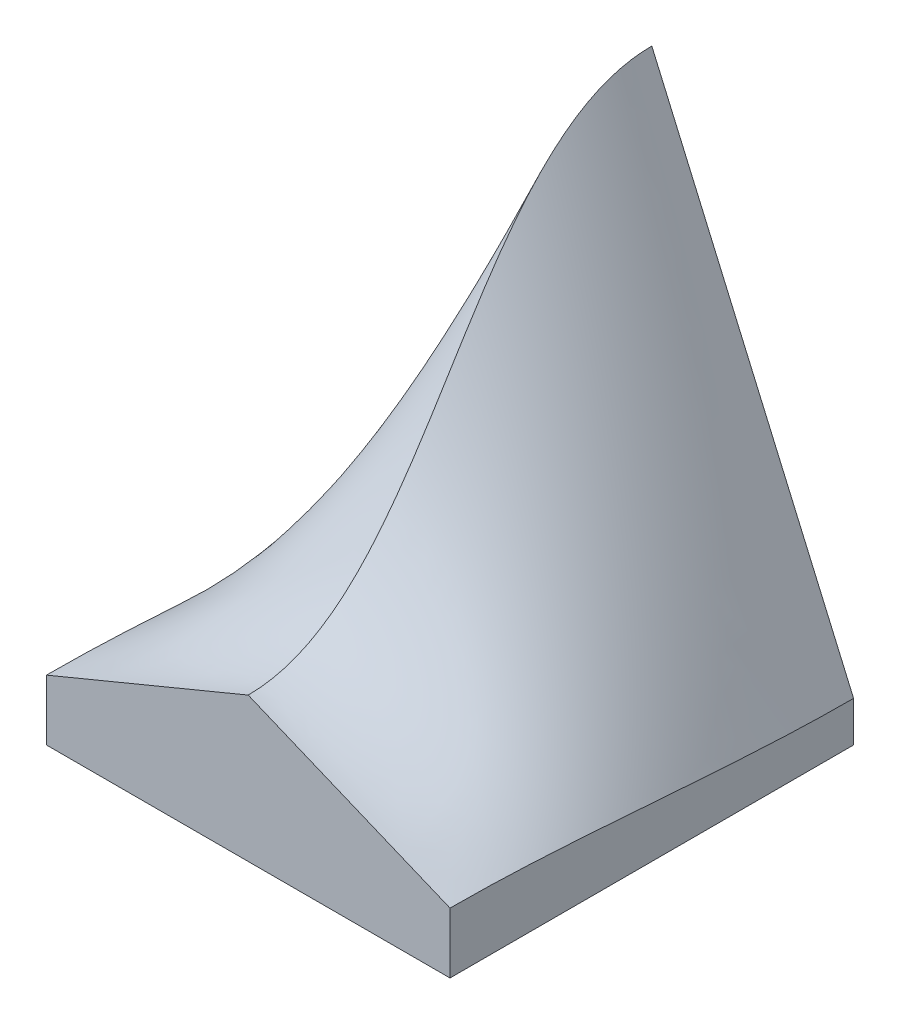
ISO-10303-21;
HEADER;
FILE_DESCRIPTION(('STEP AP214'),'2;1');
FILE_NAME('part.step','',(''),(''),'','','');
FILE_SCHEMA(('AUTOMOTIVE_DESIGN { 1 0 10303 214 1 1 1 1 }'));
ENDSEC;
DATA;
#1=APPLICATION_CONTEXT('core data for automotive mechanical design processes');
#2=APPLICATION_PROTOCOL_DEFINITION('international standard','automotive_design',2000,#1);
#3=PRODUCT_CONTEXT('',#1,'mechanical');
#4=PRODUCT('Part','Part','',(#3));
#5=PRODUCT_RELATED_PRODUCT_CATEGORY('part','',(#4));
#6=PRODUCT_DEFINITION_FORMATION('','',#4);
#7=PRODUCT_DEFINITION_CONTEXT('part definition',#1,'design');
#8=PRODUCT_DEFINITION('design','',#6,#7);
#9=PRODUCT_DEFINITION_SHAPE('','',#8);
#10=(LENGTH_UNIT() NAMED_UNIT(*) SI_UNIT(.MILLI.,.METRE.));
#11=(NAMED_UNIT(*) PLANE_ANGLE_UNIT() SI_UNIT($,.RADIAN.));
#12=(NAMED_UNIT(*) SI_UNIT($,.STERADIAN.) SOLID_ANGLE_UNIT());
#13=UNCERTAINTY_MEASURE_WITH_UNIT(LENGTH_MEASURE(1.E-05),#10,'distance_accuracy_value','');
#14=(GEOMETRIC_REPRESENTATION_CONTEXT(3) GLOBAL_UNCERTAINTY_ASSIGNED_CONTEXT((#13)) GLOBAL_UNIT_ASSIGNED_CONTEXT((#10,
#11,#12)) REPRESENTATION_CONTEXT('',''));
#15=CARTESIAN_POINT('',(0.,0.,0.));
#16=DIRECTION('',(0.,0.,1.));
#17=DIRECTION('',(1.,0.,0.));
#18=AXIS2_PLACEMENT_3D('',#15,#16,#17);
#19=CARTESIAN_POINT('',(0.,0.,-50.0000000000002));
#20=DIRECTION('',(0.,0.,1.));
#21=DIRECTION('',(1.,0.,0.));
#22=AXIS2_PLACEMENT_3D('',#19,#20,#21);
#23=PLANE('',#22);
#24=DIRECTION('',(0.,-1.,0.));
#25=VECTOR('',#24,1.);
#26=CARTESIAN_POINT('',(-25.,5.,-50.0000000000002));
#27=LINE('',#26,#25);
#28=CARTESIAN_POINT('',(-25.,5.,-50.0000000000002));
#29=VERTEX_POINT('',#28);
#30=CARTESIAN_POINT('',(-25.,0.,-50.0000000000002));
#31=VERTEX_POINT('',#30);
#32=EDGE_CURVE('E296',#29,#31,#27,.T.);
#33=ORIENTED_EDGE('',*,*,#32,.F.);
#34=DIRECTION('',(-0.398749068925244,-0.917060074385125,0.));
#35=VECTOR('',#34,1.);
#36=CARTESIAN_POINT('',(-25.,5.,-50.0000000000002));
#37=LINE('',#36,#35);
#38=CARTESIAN_POINT('',(0.,62.4960636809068,-50.0000000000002));
#39=VERTEX_POINT('',#38);
#40=EDGE_CURVE('E12',#39,#29,#37,.T.);
#41=ORIENTED_EDGE('',*,*,#40,.F.);
#42=DIRECTION('',(-0.398749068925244,0.917060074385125,0.));
#43=VECTOR('',#42,1.);
#44=CARTESIAN_POINT('',(0.,62.4960636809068,-50.0000000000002));
#45=LINE('',#44,#43);
#46=CARTESIAN_POINT('',(25.,5.00000000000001,-50.0000000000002));
#47=VERTEX_POINT('',#46);
#48=EDGE_CURVE('E102',#47,#39,#45,.T.);
#49=ORIENTED_EDGE('',*,*,#48,.F.);
#50=DIRECTION('',(0.,1.,0.));
#51=VECTOR('',#50,1.);
#52=CARTESIAN_POINT('',(25.,5.00000000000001,-50.0000000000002));
#53=LINE('',#52,#51);
#54=CARTESIAN_POINT('',(25.,0.,-50.0000000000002));
#55=VERTEX_POINT('',#54);
#56=EDGE_CURVE('E116',#55,#47,#53,.T.);
#57=ORIENTED_EDGE('',*,*,#56,.F.);
#58=DIRECTION('',(1.,0.,0.));
#59=VECTOR('',#58,1.);
#60=CARTESIAN_POINT('',(-25.,0.,-50.0000000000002));
#61=LINE('',#60,#59);
#62=EDGE_CURVE('E110',#31,#55,#61,.T.);
#63=ORIENTED_EDGE('',*,*,#62,.F.);
#64=EDGE_LOOP('',(#33,#41,#49,#57,#63));
#65=FACE_BOUND('',#64,.T.);
#66=ADVANCED_FACE('F92',(#65),#23,.F.);
#67=CARTESIAN_POINT('',(0.,0.,0.));
#68=DIRECTION('',(0.,0.,1.));
#69=DIRECTION('',(1.,0.,0.));
#70=AXIS2_PLACEMENT_3D('',#67,#68,#69);
#71=PLANE('',#70);
#72=DIRECTION('',(0.,1.,0.));
#73=VECTOR('',#72,1.);
#74=CARTESIAN_POINT('',(-25.,7.5,0.));
#75=LINE('',#74,#73);
#76=CARTESIAN_POINT('',(-25.,0.,0.));
#77=VERTEX_POINT('',#76);
#78=CARTESIAN_POINT('',(-25.,7.5,0.));
#79=VERTEX_POINT('',#78);
#80=EDGE_CURVE('E149',#77,#79,#75,.T.);
#81=ORIENTED_EDGE('',*,*,#80,.F.);
#82=DIRECTION('',(-1.,0.,0.));
#83=VECTOR('',#82,1.);
#84=CARTESIAN_POINT('',(-25.,0.,0.));
#85=LINE('',#84,#83);
#86=CARTESIAN_POINT('',(25.,0.,0.));
#87=VERTEX_POINT('',#86);
#88=EDGE_CURVE('E169',#87,#77,#85,.T.);
#89=ORIENTED_EDGE('',*,*,#88,.F.);
#90=DIRECTION('',(0.,-1.,0.));
#91=VECTOR('',#90,1.);
#92=CARTESIAN_POINT('',(25.,7.5,0.));
#93=LINE('',#92,#91);
#94=CARTESIAN_POINT('',(25.,7.5,0.));
#95=VERTEX_POINT('',#94);
#96=EDGE_CURVE('E319',#95,#87,#93,.T.);
#97=ORIENTED_EDGE('',*,*,#96,.F.);
#98=DIRECTION('',(0.923879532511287,-0.382683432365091,0.));
#99=VECTOR('',#98,1.);
#100=CARTESIAN_POINT('',(0.,17.8553390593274,0.));
#101=LINE('',#100,#99);
#102=CARTESIAN_POINT('',(0.,17.8553390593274,0.));
#103=VERTEX_POINT('',#102);
#104=EDGE_CURVE('E152',#103,#95,#101,.T.);
#105=ORIENTED_EDGE('',*,*,#104,.F.);
#106=DIRECTION('',(0.923879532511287,0.382683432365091,0.));
#107=VECTOR('',#106,1.);
#108=CARTESIAN_POINT('',(-25.,7.5,0.));
#109=LINE('',#108,#107);
#110=EDGE_CURVE('E144',#79,#103,#109,.T.);
#111=ORIENTED_EDGE('',*,*,#110,.F.);
#112=EDGE_LOOP('',(#81,#89,#97,#105,#111));
#113=FACE_BOUND('',#112,.T.);
#114=ADVANCED_FACE('F147',(#113),#71,.T.);
#115=CARTESIAN_POINT('',(25.,0.,0.));
#116=DIRECTION('',(0.,-1.,0.));
#117=DIRECTION('',(-1.,0.,0.));
#118=AXIS2_PLACEMENT_3D('',#115,#116,#117);
#119=PLANE('',#118);
#120=ORIENTED_EDGE('',*,*,#88,.T.);
#121=DIRECTION('',(0.,0.,-1.));
#122=VECTOR('',#121,1.);
#123=CARTESIAN_POINT('',(-25.,0.,-25.0000000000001));
#124=LINE('',#123,#122);
#125=EDGE_CURVE('E168',#77,#31,#124,.T.);
#126=ORIENTED_EDGE('',*,*,#125,.T.);
#127=ORIENTED_EDGE('',*,*,#62,.T.);
#128=DIRECTION('',(0.,0.,1.));
#129=VECTOR('',#128,1.);
#130=CARTESIAN_POINT('',(25.,0.,-25.0000000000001));
#131=LINE('',#130,#129);
#132=EDGE_CURVE('E158',#55,#87,#131,.T.);
#133=ORIENTED_EDGE('',*,*,#132,.T.);
#134=EDGE_LOOP('',(#120,#126,#127,#133));
#135=FACE_BOUND('',#134,.T.);
#136=ADVANCED_FACE('F276',(#135),#119,.T.);
#137=CARTESIAN_POINT('',(-25.,0.,0.));
#138=DIRECTION('',(-1.,0.,0.));
#139=DIRECTION('',(0.,1.,0.));
#140=AXIS2_PLACEMENT_3D('',#137,#138,#139);
#141=PLANE('',#140);
#142=ORIENTED_EDGE('',*,*,#80,.T.);
#143=CARTESIAN_POINT('',(-25.,7.5,0.));
#144=CARTESIAN_POINT('',(-25.,7.5,-16.6874869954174));
#145=CARTESIAN_POINT('',(-25.,5.,-33.3125130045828));
#146=CARTESIAN_POINT('',(-25.,5.,-50.0000000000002));
#147=B_SPLINE_CURVE_WITH_KNOTS('',3,(#143,#144,#145,#146),.UNSPECIFIED.,.F.,.F.,(4,4),(0.,1.),.UNSPECIFIED.);
#148=EDGE_CURVE('E166',#79,#29,#147,.T.);
#149=ORIENTED_EDGE('',*,*,#148,.T.);
#150=ORIENTED_EDGE('',*,*,#32,.T.);
#151=ORIENTED_EDGE('',*,*,#125,.F.);
#152=EDGE_LOOP('',(#142,#149,#150,#151));
#153=FACE_BOUND('',#152,.T.);
#154=ADVANCED_FACE('F165',(#153),#141,.T.);
#155=CARTESIAN_POINT('',(25.,7.5,0.));
#156=DIRECTION('',(1.,0.,0.));
#157=DIRECTION('',(0.,-1.,0.));
#158=AXIS2_PLACEMENT_3D('',#155,#156,#157);
#159=PLANE('',#158);
#160=ORIENTED_EDGE('',*,*,#96,.T.);
#161=ORIENTED_EDGE('',*,*,#132,.F.);
#162=ORIENTED_EDGE('',*,*,#56,.T.);
#163=CARTESIAN_POINT('',(25.,7.5,0.));
#164=CARTESIAN_POINT('',(25.,7.5,-16.6874869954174));
#165=CARTESIAN_POINT('',(25.,5.00000000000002,-33.3125130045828));
#166=CARTESIAN_POINT('',(25.,5.00000000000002,-50.0000000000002));
#167=B_SPLINE_CURVE_WITH_KNOTS('',3,(#163,#164,#165,#166),.UNSPECIFIED.,.F.,.F.,(4,4),(0.,1.),.UNSPECIFIED.);
#168=EDGE_CURVE('E177',#95,#47,#167,.T.);
#169=ORIENTED_EDGE('',*,*,#168,.F.);
#170=EDGE_LOOP('',(#160,#161,#162,#169));
#171=FACE_BOUND('',#170,.T.);
#172=ADVANCED_FACE('F246',(#171),#159,.T.);
#173=CARTESIAN_POINT('',(-25.,7.5,0.));
#174=CARTESIAN_POINT('',(-25.,7.5,-16.6874869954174));
#175=CARTESIAN_POINT('',(-25.,5.,-33.3125130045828));
#176=CARTESIAN_POINT('',(-25.,5.,-50.0000000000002));
#177=CARTESIAN_POINT('',(-16.6666666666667,10.9517796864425,0.));
#178=CARTESIAN_POINT('',(-16.6666666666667,10.9517796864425,-18.572581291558));
#179=CARTESIAN_POINT('',(-16.6666666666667,24.1653545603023,-31.4274187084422));
#180=CARTESIAN_POINT('',(-16.6666666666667,24.1653545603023,-50.0000000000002));
#181=CARTESIAN_POINT('',(-8.33333333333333,14.4035593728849,0.));
#182=CARTESIAN_POINT('',(-8.33333333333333,14.4035593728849,-20.4576755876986));
#183=CARTESIAN_POINT('',(-8.33333333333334,43.3307091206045,-29.5423244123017));
#184=CARTESIAN_POINT('',(-8.33333333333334,43.3307091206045,-50.0000000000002));
#185=CARTESIAN_POINT('',(0.,17.8553390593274,0.));
#186=CARTESIAN_POINT('',(0.,17.8553390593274,-22.3427698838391));
#187=CARTESIAN_POINT('',(0.,62.4960636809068,-27.6572301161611));
#188=CARTESIAN_POINT('',(0.,62.4960636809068,-50.0000000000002));
#189=B_SPLINE_SURFACE_WITH_KNOTS('',3,3,((#173,#174,#175,#176),(#177,#178,#179,#180),(#181,#182,
#183,#184),(#185,#186,#187,#188)),.UNSPECIFIED.,.F.,.F.,.F.,(4,4),(4,4),(0.,1.),(0.,1.),.UNSPECIFIED.);
#190=CARTESIAN_POINT('',(0.,17.8553390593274,0.));
#191=CARTESIAN_POINT('',(0.,17.8553390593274,-22.3427698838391));
#192=CARTESIAN_POINT('',(0.,62.4960636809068,-27.6572301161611));
#193=CARTESIAN_POINT('',(0.,62.4960636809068,-50.0000000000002));
#194=B_SPLINE_CURVE_WITH_KNOTS('',3,(#190,#191,#192,#193),.UNSPECIFIED.,.F.,.F.,(4,4),(0.,1.),.UNSPECIFIED.);
#195=EDGE_CURVE('E175',#103,#39,#194,.T.);
#196=ORIENTED_EDGE('',*,*,#110,.T.);
#197=ORIENTED_EDGE('',*,*,#195,.T.);
#198=ORIENTED_EDGE('',*,*,#40,.T.);
#199=ORIENTED_EDGE('',*,*,#148,.F.);
#200=EDGE_LOOP('',(#196,#197,#198,#199));
#201=FACE_BOUND('',#200,.T.);
#202=ADVANCED_FACE('F173',(#201),#189,.T.);
#203=CARTESIAN_POINT('',(0.,17.8553390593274,0.));
#204=CARTESIAN_POINT('',(0.,17.8553390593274,-22.3427698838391));
#205=CARTESIAN_POINT('',(0.,62.4960636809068,-27.6572301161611));
#206=CARTESIAN_POINT('',(0.,62.4960636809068,-50.0000000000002));
#207=CARTESIAN_POINT('',(8.33333333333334,14.4035593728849,0.));
#208=CARTESIAN_POINT('',(8.33333333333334,14.4035593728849,-20.4576755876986));
#209=CARTESIAN_POINT('',(8.33333333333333,43.3307091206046,-29.5423244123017));
#210=CARTESIAN_POINT('',(8.33333333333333,43.3307091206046,-50.0000000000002));
#211=CARTESIAN_POINT('',(16.6666666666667,10.9517796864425,0.));
#212=CARTESIAN_POINT('',(16.6666666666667,10.9517796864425,-18.572581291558));
#213=CARTESIAN_POINT('',(16.6666666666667,24.1653545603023,-31.4274187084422));
#214=CARTESIAN_POINT('',(16.6666666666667,24.1653545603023,-50.0000000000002));
#215=CARTESIAN_POINT('',(25.,7.5,0.));
#216=CARTESIAN_POINT('',(25.,7.5,-16.6874869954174));
#217=CARTESIAN_POINT('',(25.,5.00000000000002,-33.3125130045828));
#218=CARTESIAN_POINT('',(25.,5.00000000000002,-50.0000000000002));
#219=B_SPLINE_SURFACE_WITH_KNOTS('',3,3,((#203,#204,#205,#206),(#207,#208,#209,#210),(#211,#212,
#213,#214),(#215,#216,#217,#218)),.UNSPECIFIED.,.F.,.F.,.F.,(4,4),(4,4),(0.,1.),(0.,1.),.UNSPECIFIED.);
#220=ORIENTED_EDGE('',*,*,#104,.T.);
#221=ORIENTED_EDGE('',*,*,#168,.T.);
#222=ORIENTED_EDGE('',*,*,#48,.T.);
#223=ORIENTED_EDGE('',*,*,#195,.F.);
#224=EDGE_LOOP('',(#220,#221,#222,#223));
#225=FACE_BOUND('',#224,.T.);
#226=ADVANCED_FACE('F207',(#225),#219,.T.);
#227=CLOSED_SHELL('',(#66,#114,#136,#154,#172,#202,#226));
#228=MANIFOLD_SOLID_BREP('B2',#227);
#229=ADVANCED_BREP_SHAPE_REPRESENTATION('',(#18,#228),#14);
#230=SHAPE_DEFINITION_REPRESENTATION(#9,#229);
ENDSEC;
END-ISO-10303-21;
